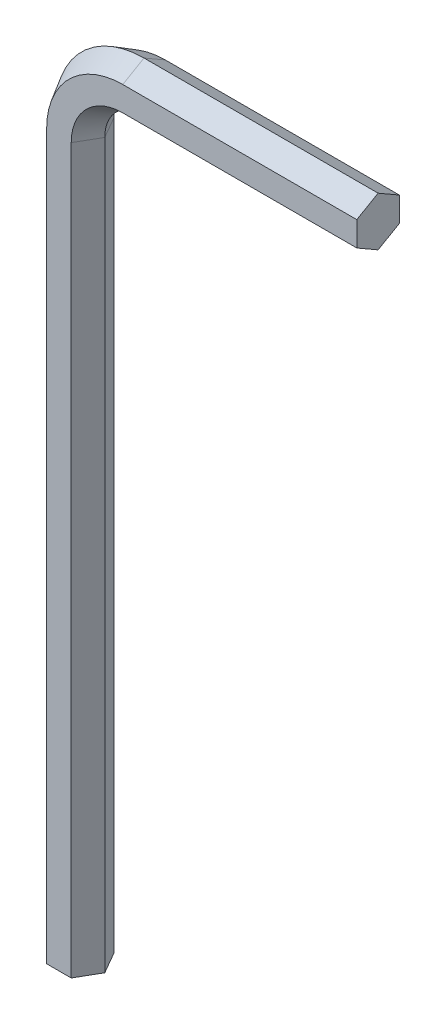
ISO-10303-21;
HEADER;
FILE_DESCRIPTION(('STEP AP214'),'2;1');
FILE_NAME('part.step','',(''),(''),'','','');
FILE_SCHEMA(('AUTOMOTIVE_DESIGN { 1 0 10303 214 1 1 1 1 }'));
ENDSEC;
DATA;
#1=APPLICATION_CONTEXT('core data for automotive mechanical design processes');
#2=APPLICATION_PROTOCOL_DEFINITION('international standard','automotive_design',2000,#1);
#3=PRODUCT_CONTEXT('',#1,'mechanical');
#4=PRODUCT('Part','Part','',(#3));
#5=PRODUCT_RELATED_PRODUCT_CATEGORY('part','',(#4));
#6=PRODUCT_DEFINITION_FORMATION('','',#4);
#7=PRODUCT_DEFINITION_CONTEXT('part definition',#1,'design');
#8=PRODUCT_DEFINITION('design','',#6,#7);
#9=PRODUCT_DEFINITION_SHAPE('','',#8);
#10=(LENGTH_UNIT() NAMED_UNIT(*) SI_UNIT(.MILLI.,.METRE.));
#11=(NAMED_UNIT(*) PLANE_ANGLE_UNIT() SI_UNIT($,.RADIAN.));
#12=(NAMED_UNIT(*) SI_UNIT($,.STERADIAN.) SOLID_ANGLE_UNIT());
#13=UNCERTAINTY_MEASURE_WITH_UNIT(LENGTH_MEASURE(1.E-05),#10,'distance_accuracy_value','');
#14=(GEOMETRIC_REPRESENTATION_CONTEXT(3) GLOBAL_UNCERTAINTY_ASSIGNED_CONTEXT((#13)) GLOBAL_UNIT_ASSIGNED_CONTEXT((#10,
#11,#12)) REPRESENTATION_CONTEXT('',''));
#15=CARTESIAN_POINT('',(0.,0.,0.));
#16=DIRECTION('',(0.,0.,1.));
#17=DIRECTION('',(1.,0.,0.));
#18=AXIS2_PLACEMENT_3D('',#15,#16,#17);
#19=CARTESIAN_POINT('',(6.,71.6905989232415,0.));
#20=DIRECTION('',(0.,-0.866025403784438,-0.500000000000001));
#21=DIRECTION('',(0.,0.500000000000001,-0.866025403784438));
#22=AXIS2_PLACEMENT_3D('',#19,#20,#21);
#23=PLANE('',#22);
#24=DIRECTION('',(0.,0.500000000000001,-0.866025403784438));
#25=VECTOR('',#24,1.);
#26=CARTESIAN_POINT('',(6.,71.6905989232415,0.));
#27=LINE('',#26,#25);
#28=CARTESIAN_POINT('',(6.,71.6905989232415,0.));
#29=VERTEX_POINT('',#28);
#30=CARTESIAN_POINT('',(6.,72.8452994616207,-2.));
#31=VERTEX_POINT('',#30);
#32=EDGE_CURVE('E130',#29,#31,#27,.T.);
#33=ORIENTED_EDGE('',*,*,#32,.T.);
#34=DIRECTION('',(1.,0.,0.));
#35=VECTOR('',#34,1.);
#36=CARTESIAN_POINT('',(6.,72.8452994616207,-2.));
#37=LINE('',#36,#35);
#38=CARTESIAN_POINT('',(28.,72.8452994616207,-2.));
#39=VERTEX_POINT('',#38);
#40=EDGE_CURVE('E39',#31,#39,#37,.T.);
#41=ORIENTED_EDGE('',*,*,#40,.T.);
#42=DIRECTION('',(0.,0.500000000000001,-0.866025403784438));
#43=VECTOR('',#42,1.);
#44=CARTESIAN_POINT('',(28.,71.6905989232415,0.));
#45=LINE('',#44,#43);
#46=CARTESIAN_POINT('',(28.,71.6905989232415,0.));
#47=VERTEX_POINT('',#46);
#48=EDGE_CURVE('E46',#47,#39,#45,.T.);
#49=ORIENTED_EDGE('',*,*,#48,.F.);
#50=DIRECTION('',(1.,0.,0.));
#51=VECTOR('',#50,1.);
#52=CARTESIAN_POINT('',(6.,71.6905989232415,0.));
#53=LINE('',#52,#51);
#54=EDGE_CURVE('E11',#29,#47,#53,.T.);
#55=ORIENTED_EDGE('',*,*,#54,.F.);
#56=EDGE_LOOP('',(#33,#41,#49,#55));
#57=FACE_BOUND('',#56,.T.);
#58=ADVANCED_FACE('F32',(#57),#23,.T.);
#59=CARTESIAN_POINT('',(6.,75.1547005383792,-2.));
#60=DIRECTION('',(0.,0.866025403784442,-0.499999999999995));
#61=DIRECTION('',(0.,0.499999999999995,0.866025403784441));
#62=AXIS2_PLACEMENT_3D('',#59,#60,#61);
#63=PLANE('',#62);
#64=DIRECTION('',(0.,0.499999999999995,0.866025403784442));
#65=VECTOR('',#64,1.);
#66=CARTESIAN_POINT('',(6.,75.1547005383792,-2.));
#67=LINE('',#66,#65);
#68=CARTESIAN_POINT('',(6.,75.1547005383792,-2.));
#69=VERTEX_POINT('',#68);
#70=CARTESIAN_POINT('',(6.,76.3094010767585,0.));
#71=VERTEX_POINT('',#70);
#72=EDGE_CURVE('E170',#69,#71,#67,.T.);
#73=ORIENTED_EDGE('',*,*,#72,.T.);
#74=DIRECTION('',(1.,0.,0.));
#75=VECTOR('',#74,1.);
#76=CARTESIAN_POINT('',(6.,76.3094010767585,0.));
#77=LINE('',#76,#75);
#78=CARTESIAN_POINT('',(28.,76.3094010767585,0.));
#79=VERTEX_POINT('',#78);
#80=EDGE_CURVE('E203',#71,#79,#77,.T.);
#81=ORIENTED_EDGE('',*,*,#80,.T.);
#82=DIRECTION('',(0.,0.499999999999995,0.866025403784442));
#83=VECTOR('',#82,1.);
#84=CARTESIAN_POINT('',(28.,75.1547005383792,-2.));
#85=LINE('',#84,#83);
#86=CARTESIAN_POINT('',(28.,75.1547005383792,-2.));
#87=VERTEX_POINT('',#86);
#88=EDGE_CURVE('E192',#87,#79,#85,.T.);
#89=ORIENTED_EDGE('',*,*,#88,.F.);
#90=DIRECTION('',(1.,0.,0.));
#91=VECTOR('',#90,1.);
#92=CARTESIAN_POINT('',(6.,75.1547005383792,-2.));
#93=LINE('',#92,#91);
#94=EDGE_CURVE('E206',#69,#87,#93,.T.);
#95=ORIENTED_EDGE('',*,*,#94,.F.);
#96=EDGE_LOOP('',(#73,#81,#89,#95));
#97=FACE_BOUND('',#96,.T.);
#98=ADVANCED_FACE('F244',(#97),#63,.T.);
#99=CARTESIAN_POINT('',(6.,76.3094010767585,0.));
#100=DIRECTION('',(0.,0.866025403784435,0.500000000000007));
#101=DIRECTION('',(0.,-0.500000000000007,0.866025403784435));
#102=AXIS2_PLACEMENT_3D('',#99,#100,#101);
#103=PLANE('',#102);
#104=DIRECTION('',(0.,-0.500000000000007,0.866025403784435));
#105=VECTOR('',#104,1.);
#106=CARTESIAN_POINT('',(6.,76.3094010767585,0.));
#107=LINE('',#106,#105);
#108=CARTESIAN_POINT('',(6.,75.1547005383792,2.00000000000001));
#109=VERTEX_POINT('',#108);
#110=EDGE_CURVE('E162',#71,#109,#107,.T.);
#111=ORIENTED_EDGE('',*,*,#110,.T.);
#112=DIRECTION('',(1.,0.,0.));
#113=VECTOR('',#112,1.);
#114=CARTESIAN_POINT('',(6.,75.1547005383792,2.00000000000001));
#115=LINE('',#114,#113);
#116=CARTESIAN_POINT('',(28.,75.1547005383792,2.00000000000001));
#117=VERTEX_POINT('',#116);
#118=EDGE_CURVE('E200',#109,#117,#115,.T.);
#119=ORIENTED_EDGE('',*,*,#118,.T.);
#120=DIRECTION('',(0.,-0.500000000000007,0.866025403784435));
#121=VECTOR('',#120,1.);
#122=CARTESIAN_POINT('',(28.,76.3094010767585,0.));
#123=LINE('',#122,#121);
#124=EDGE_CURVE('E189',#79,#117,#123,.T.);
#125=ORIENTED_EDGE('',*,*,#124,.F.);
#126=ORIENTED_EDGE('',*,*,#80,.F.);
#127=EDGE_LOOP('',(#111,#119,#125,#126));
#128=FACE_BOUND('',#127,.T.);
#129=ADVANCED_FACE('F249',(#128),#103,.T.);
#130=CARTESIAN_POINT('',(6.,72.8452994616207,1.99999999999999));
#131=DIRECTION('',(0.,-0.866025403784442,0.499999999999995));
#132=DIRECTION('',(0.,-0.499999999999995,-0.866025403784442));
#133=AXIS2_PLACEMENT_3D('',#130,#131,#132);
#134=PLANE('',#133);
#135=DIRECTION('',(0.,-0.499999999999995,-0.866025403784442));
#136=VECTOR('',#135,1.);
#137=CARTESIAN_POINT('',(6.,72.8452994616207,1.99999999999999));
#138=LINE('',#137,#136);
#139=CARTESIAN_POINT('',(6.,72.8452994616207,1.99999999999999));
#140=VERTEX_POINT('',#139);
#141=EDGE_CURVE('E159',#140,#29,#138,.T.);
#142=ORIENTED_EDGE('',*,*,#141,.T.);
#143=ORIENTED_EDGE('',*,*,#54,.T.);
#144=DIRECTION('',(0.,-0.499999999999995,-0.866025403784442));
#145=VECTOR('',#144,1.);
#146=CARTESIAN_POINT('',(28.,72.8452994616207,1.99999999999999));
#147=LINE('',#146,#145);
#148=CARTESIAN_POINT('',(28.,72.8452994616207,1.99999999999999));
#149=VERTEX_POINT('',#148);
#150=EDGE_CURVE('E133',#149,#47,#147,.T.);
#151=ORIENTED_EDGE('',*,*,#150,.F.);
#152=DIRECTION('',(1.,0.,0.));
#153=VECTOR('',#152,1.);
#154=CARTESIAN_POINT('',(6.,72.8452994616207,1.99999999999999));
#155=LINE('',#154,#153);
#156=EDGE_CURVE('E197',#140,#149,#155,.T.);
#157=ORIENTED_EDGE('',*,*,#156,.F.);
#158=EDGE_LOOP('',(#142,#143,#151,#157));
#159=FACE_BOUND('',#158,.T.);
#160=ADVANCED_FACE('F253',(#159),#134,.T.);
#161=CARTESIAN_POINT('',(6.,68.,0.));
#162=DIRECTION('',(0.,0.,-1.));
#163=DIRECTION('',(-1.,0.,0.));
#164=AXIS2_PLACEMENT_3D('',#161,#162,#163);
#165=CONICAL_SURFACE('',#164,3.6905989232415,0.5235987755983);
#166=DIRECTION('',(-0.500000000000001,0.,-0.866025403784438));
#167=VECTOR('',#166,1.);
#168=CARTESIAN_POINT('',(2.3094010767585,68.,0.));
#169=LINE('',#168,#167);
#170=CARTESIAN_POINT('',(2.3094010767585,68.,0.));
#171=VERTEX_POINT('',#170);
#172=CARTESIAN_POINT('',(1.15470053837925,68.,-2.));
#173=VERTEX_POINT('',#172);
#174=EDGE_CURVE('E127',#171,#173,#169,.T.);
#175=ORIENTED_EDGE('',*,*,#174,.T.);
#176=CARTESIAN_POINT('',(6.,68.,-2.));
#177=DIRECTION('',(0.,0.,-1.));
#178=DIRECTION('',(-1.,0.,0.));
#179=AXIS2_PLACEMENT_3D('',#176,#177,#178);
#180=CIRCLE('',#179,4.84529946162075);
#181=EDGE_CURVE('E134',#173,#31,#180,.T.);
#182=ORIENTED_EDGE('',*,*,#181,.T.);
#183=ORIENTED_EDGE('',*,*,#32,.F.);
#184=CARTESIAN_POINT('',(6.,68.,0.));
#185=DIRECTION('',(0.,0.,-1.));
#186=DIRECTION('',(-1.,0.,0.));
#187=AXIS2_PLACEMENT_3D('',#184,#185,#186);
#188=CIRCLE('',#187,3.6905989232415);
#189=EDGE_CURVE('E122',#171,#29,#188,.T.);
#190=ORIENTED_EDGE('',*,*,#189,.F.);
#191=EDGE_LOOP('',(#175,#182,#183,#190));
#192=FACE_BOUND('',#191,.T.);
#193=ADVANCED_FACE('F124',(#192),#165,.F.);
#194=CARTESIAN_POINT('',(6.,68.,-2.));
#195=DIRECTION('',(0.,0.,1.));
#196=DIRECTION('',(1.,0.,0.));
#197=AXIS2_PLACEMENT_3D('',#194,#195,#196);
#198=CONICAL_SURFACE('',#197,7.15470053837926,0.523598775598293);
#199=DIRECTION('',(-0.499999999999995,0.,0.866025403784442));
#200=VECTOR('',#199,1.);
#201=CARTESIAN_POINT('',(-1.15470053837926,68.,-2.));
#202=LINE('',#201,#200);
#203=CARTESIAN_POINT('',(-1.15470053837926,68.,-2.));
#204=VERTEX_POINT('',#203);
#205=CARTESIAN_POINT('',(-2.3094010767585,68.,0.));
#206=VERTEX_POINT('',#205);
#207=EDGE_CURVE('E154',#204,#206,#202,.T.);
#208=ORIENTED_EDGE('',*,*,#207,.T.);
#209=CARTESIAN_POINT('',(6.,68.,0.));
#210=DIRECTION('',(0.,0.,-1.));
#211=DIRECTION('',(-1.,0.,0.));
#212=AXIS2_PLACEMENT_3D('',#209,#210,#211);
#213=CIRCLE('',#212,8.3094010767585);
#214=EDGE_CURVE('E178',#206,#71,#213,.T.);
#215=ORIENTED_EDGE('',*,*,#214,.T.);
#216=ORIENTED_EDGE('',*,*,#72,.F.);
#217=CARTESIAN_POINT('',(6.,68.,-2.));
#218=DIRECTION('',(0.,0.,-1.));
#219=DIRECTION('',(-1.,0.,0.));
#220=AXIS2_PLACEMENT_3D('',#217,#218,#219);
#221=CIRCLE('',#220,7.15470053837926);
#222=EDGE_CURVE('E181',#204,#69,#221,.T.);
#223=ORIENTED_EDGE('',*,*,#222,.F.);
#224=EDGE_LOOP('',(#208,#215,#216,#223));
#225=FACE_BOUND('',#224,.T.);
#226=ADVANCED_FACE('F241',(#225),#198,.T.);
#227=CARTESIAN_POINT('',(6.,68.,0.));
#228=DIRECTION('',(0.,0.,-1.));
#229=DIRECTION('',(-1.,0.,0.));
#230=AXIS2_PLACEMENT_3D('',#227,#228,#229);
#231=CONICAL_SURFACE('',#230,8.3094010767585,0.523598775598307);
#232=DIRECTION('',(0.500000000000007,0.,0.866025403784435));
#233=VECTOR('',#232,1.);
#234=CARTESIAN_POINT('',(-2.3094010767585,68.,0.));
#235=LINE('',#234,#233);
#236=CARTESIAN_POINT('',(-1.15470053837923,68.,2.00000000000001));
#237=VERTEX_POINT('',#236);
#238=EDGE_CURVE('E229',#206,#237,#235,.T.);
#239=ORIENTED_EDGE('',*,*,#238,.T.);
#240=CARTESIAN_POINT('',(6.,68.,2.00000000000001));
#241=DIRECTION('',(0.,0.,-1.));
#242=DIRECTION('',(-1.,0.,0.));
#243=AXIS2_PLACEMENT_3D('',#240,#241,#242);
#244=CIRCLE('',#243,7.15470053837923);
#245=EDGE_CURVE('E175',#237,#109,#244,.T.);
#246=ORIENTED_EDGE('',*,*,#245,.T.);
#247=ORIENTED_EDGE('',*,*,#110,.F.);
#248=ORIENTED_EDGE('',*,*,#214,.F.);
#249=EDGE_LOOP('',(#239,#246,#247,#248));
#250=FACE_BOUND('',#249,.T.);
#251=ADVANCED_FACE('F247',(#250),#231,.T.);
#252=CARTESIAN_POINT('',(6.,68.,1.99999999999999));
#253=DIRECTION('',(0.,0.,1.));
#254=DIRECTION('',(1.,0.,0.));
#255=AXIS2_PLACEMENT_3D('',#252,#253,#254);
#256=CONICAL_SURFACE('',#255,4.84529946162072,0.523598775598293);
#257=DIRECTION('',(0.499999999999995,0.,-0.866025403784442));
#258=VECTOR('',#257,1.);
#259=CARTESIAN_POINT('',(1.15470053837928,68.,1.99999999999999));
#260=LINE('',#259,#258);
#261=CARTESIAN_POINT('',(1.15470053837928,68.,1.99999999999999));
#262=VERTEX_POINT('',#261);
#263=EDGE_CURVE('E137',#262,#171,#260,.T.);
#264=ORIENTED_EDGE('',*,*,#263,.T.);
#265=ORIENTED_EDGE('',*,*,#189,.T.);
#266=ORIENTED_EDGE('',*,*,#141,.F.);
#267=CARTESIAN_POINT('',(6.,68.,1.99999999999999));
#268=DIRECTION('',(0.,0.,-1.));
#269=DIRECTION('',(-1.,0.,0.));
#270=AXIS2_PLACEMENT_3D('',#267,#268,#269);
#271=CIRCLE('',#270,4.84529946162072);
#272=EDGE_CURVE('E140',#262,#140,#271,.T.);
#273=ORIENTED_EDGE('',*,*,#272,.F.);
#274=EDGE_LOOP('',(#264,#265,#266,#273));
#275=FACE_BOUND('',#274,.T.);
#276=ADVANCED_FACE('F138',(#275),#256,.F.);
#277=CARTESIAN_POINT('',(1.15470053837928,68.,1.99999999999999));
#278=DIRECTION('',(-0.866025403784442,0.,-0.499999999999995));
#279=DIRECTION('',(-0.499999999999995,0.,0.866025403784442));
#280=AXIS2_PLACEMENT_3D('',#277,#278,#279);
#281=PLANE('',#280);
#282=DIRECTION('',(0.499999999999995,0.,-0.866025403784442));
#283=VECTOR('',#282,1.);
#284=CARTESIAN_POINT('',(1.15470053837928,0.,1.99999999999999));
#285=LINE('',#284,#283);
#286=CARTESIAN_POINT('',(1.15470053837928,0.,1.99999999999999));
#287=VERTEX_POINT('',#286);
#288=CARTESIAN_POINT('',(2.3094010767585,0.,0.));
#289=VERTEX_POINT('',#288);
#290=EDGE_CURVE('E158',#287,#289,#285,.T.);
#291=ORIENTED_EDGE('',*,*,#290,.T.);
#292=DIRECTION('',(0.,-1.,0.));
#293=VECTOR('',#292,1.);
#294=CARTESIAN_POINT('',(2.3094010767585,68.,0.));
#295=LINE('',#294,#293);
#296=EDGE_CURVE('E150',#171,#289,#295,.T.);
#297=ORIENTED_EDGE('',*,*,#296,.F.);
#298=ORIENTED_EDGE('',*,*,#263,.F.);
#299=DIRECTION('',(0.,-1.,0.));
#300=VECTOR('',#299,1.);
#301=CARTESIAN_POINT('',(1.15470053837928,68.,1.99999999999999));
#302=LINE('',#301,#300);
#303=EDGE_CURVE('E226',#262,#287,#302,.T.);
#304=ORIENTED_EDGE('',*,*,#303,.T.);
#305=EDGE_LOOP('',(#291,#297,#298,#304));
#306=FACE_BOUND('',#305,.T.);
#307=ADVANCED_FACE('F156',(#306),#281,.F.);
#308=CARTESIAN_POINT('',(2.3094010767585,68.,0.));
#309=DIRECTION('',(-0.866025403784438,0.,0.500000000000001));
#310=DIRECTION('',(0.500000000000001,0.,0.866025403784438));
#311=AXIS2_PLACEMENT_3D('',#308,#309,#310);
#312=PLANE('',#311);
#313=DIRECTION('',(-0.500000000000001,0.,-0.866025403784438));
#314=VECTOR('',#313,1.);
#315=CARTESIAN_POINT('',(2.3094010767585,0.,0.));
#316=LINE('',#315,#314);
#317=CARTESIAN_POINT('',(1.15470053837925,0.,-2.));
#318=VERTEX_POINT('',#317);
#319=EDGE_CURVE('E215',#289,#318,#316,.T.);
#320=ORIENTED_EDGE('',*,*,#319,.T.);
#321=DIRECTION('',(0.,-1.,0.));
#322=VECTOR('',#321,1.);
#323=CARTESIAN_POINT('',(1.15470053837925,68.,-2.));
#324=LINE('',#323,#322);
#325=EDGE_CURVE('E153',#173,#318,#324,.T.);
#326=ORIENTED_EDGE('',*,*,#325,.F.);
#327=ORIENTED_EDGE('',*,*,#174,.F.);
#328=ORIENTED_EDGE('',*,*,#296,.T.);
#329=EDGE_LOOP('',(#320,#326,#327,#328));
#330=FACE_BOUND('',#329,.T.);
#331=ADVANCED_FACE('F149',(#330),#312,.F.);
#332=CARTESIAN_POINT('',(1.15470053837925,68.,-2.));
#333=DIRECTION('',(0.,0.,1.));
#334=DIRECTION('',(1.,0.,0.));
#335=AXIS2_PLACEMENT_3D('',#332,#333,#334);
#336=PLANE('',#335);
#337=DIRECTION('',(-1.,0.,0.));
#338=VECTOR('',#337,1.);
#339=CARTESIAN_POINT('',(1.15470053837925,0.,-2.));
#340=LINE('',#339,#338);
#341=CARTESIAN_POINT('',(-1.15470053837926,0.,-2.));
#342=VERTEX_POINT('',#341);
#343=EDGE_CURVE('E210',#318,#342,#340,.T.);
#344=ORIENTED_EDGE('',*,*,#343,.T.);
#345=DIRECTION('',(0.,-1.,0.));
#346=VECTOR('',#345,1.);
#347=CARTESIAN_POINT('',(-1.15470053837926,68.,-2.));
#348=LINE('',#347,#346);
#349=EDGE_CURVE('E164',#204,#342,#348,.T.);
#350=ORIENTED_EDGE('',*,*,#349,.F.);
#351=ORIENTED_EDGE('',*,*,#222,.T.);
#352=ORIENTED_EDGE('',*,*,#94,.T.);
#353=DIRECTION('',(0.,1.,0.));
#354=VECTOR('',#353,1.);
#355=CARTESIAN_POINT('',(28.,72.8452994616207,-2.));
#356=LINE('',#355,#354);
#357=EDGE_CURVE('E54',#39,#87,#356,.T.);
#358=ORIENTED_EDGE('',*,*,#357,.F.);
#359=ORIENTED_EDGE('',*,*,#40,.F.);
#360=ORIENTED_EDGE('',*,*,#181,.F.);
#361=ORIENTED_EDGE('',*,*,#325,.T.);
#362=EDGE_LOOP('',(#344,#350,#351,#352,#358,#359,#360,#361));
#363=FACE_BOUND('',#362,.T.);
#364=ADVANCED_FACE('F207',(#363),#336,.F.);
#365=CARTESIAN_POINT('',(-1.15470053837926,68.,-2.));
#366=DIRECTION('',(0.866025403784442,0.,0.499999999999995));
#367=DIRECTION('',(0.499999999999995,0.,-0.866025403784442));
#368=AXIS2_PLACEMENT_3D('',#365,#366,#367);
#369=PLANE('',#368);
#370=DIRECTION('',(-0.499999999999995,0.,0.866025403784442));
#371=VECTOR('',#370,1.);
#372=CARTESIAN_POINT('',(-1.15470053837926,0.,-2.));
#373=LINE('',#372,#371);
#374=CARTESIAN_POINT('',(-2.3094010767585,0.,0.));
#375=VERTEX_POINT('',#374);
#376=EDGE_CURVE('E217',#342,#375,#373,.T.);
#377=ORIENTED_EDGE('',*,*,#376,.T.);
#378=DIRECTION('',(0.,-1.,0.));
#379=VECTOR('',#378,1.);
#380=CARTESIAN_POINT('',(-2.3094010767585,68.,0.));
#381=LINE('',#380,#379);
#382=EDGE_CURVE('E232',#206,#375,#381,.T.);
#383=ORIENTED_EDGE('',*,*,#382,.F.);
#384=ORIENTED_EDGE('',*,*,#207,.F.);
#385=ORIENTED_EDGE('',*,*,#349,.T.);
#386=EDGE_LOOP('',(#377,#383,#384,#385));
#387=FACE_BOUND('',#386,.T.);
#388=ADVANCED_FACE('F236',(#387),#369,.F.);
#389=CARTESIAN_POINT('',(-2.3094010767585,68.,0.));
#390=DIRECTION('',(0.866025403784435,0.,-0.500000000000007));
#391=DIRECTION('',(-0.500000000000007,0.,-0.866025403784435));
#392=AXIS2_PLACEMENT_3D('',#389,#390,#391);
#393=PLANE('',#392);
#394=DIRECTION('',(0.500000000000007,0.,0.866025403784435));
#395=VECTOR('',#394,1.);
#396=CARTESIAN_POINT('',(-2.3094010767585,0.,0.));
#397=LINE('',#396,#395);
#398=CARTESIAN_POINT('',(-1.15470053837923,0.,2.00000000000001));
#399=VERTEX_POINT('',#398);
#400=EDGE_CURVE('E219',#375,#399,#397,.T.);
#401=ORIENTED_EDGE('',*,*,#400,.T.);
#402=DIRECTION('',(0.,-1.,0.));
#403=VECTOR('',#402,1.);
#404=CARTESIAN_POINT('',(-1.15470053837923,68.,2.00000000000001));
#405=LINE('',#404,#403);
#406=EDGE_CURVE('E228',#237,#399,#405,.T.);
#407=ORIENTED_EDGE('',*,*,#406,.F.);
#408=ORIENTED_EDGE('',*,*,#238,.F.);
#409=ORIENTED_EDGE('',*,*,#382,.T.);
#410=EDGE_LOOP('',(#401,#407,#408,#409));
#411=FACE_BOUND('',#410,.T.);
#412=ADVANCED_FACE('F262',(#411),#393,.F.);
#413=CARTESIAN_POINT('',(-1.15470053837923,68.,2.00000000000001));
#414=DIRECTION('',(0.,0.,-1.));
#415=DIRECTION('',(-1.,0.,0.));
#416=AXIS2_PLACEMENT_3D('',#413,#414,#415);
#417=PLANE('',#416);
#418=DIRECTION('',(1.,0.,0.));
#419=VECTOR('',#418,1.);
#420=CARTESIAN_POINT('',(-1.15470053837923,0.,2.00000000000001));
#421=LINE('',#420,#419);
#422=EDGE_CURVE('E145',#399,#287,#421,.T.);
#423=ORIENTED_EDGE('',*,*,#422,.T.);
#424=ORIENTED_EDGE('',*,*,#303,.F.);
#425=ORIENTED_EDGE('',*,*,#272,.T.);
#426=ORIENTED_EDGE('',*,*,#156,.T.);
#427=DIRECTION('',(0.,-1.,0.));
#428=VECTOR('',#427,1.);
#429=CARTESIAN_POINT('',(28.,75.1547005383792,2.00000000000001));
#430=LINE('',#429,#428);
#431=EDGE_CURVE('E186',#117,#149,#430,.T.);
#432=ORIENTED_EDGE('',*,*,#431,.F.);
#433=ORIENTED_EDGE('',*,*,#118,.F.);
#434=ORIENTED_EDGE('',*,*,#245,.F.);
#435=ORIENTED_EDGE('',*,*,#406,.T.);
#436=EDGE_LOOP('',(#423,#424,#425,#426,#432,#433,#434,#435));
#437=FACE_BOUND('',#436,.T.);
#438=ADVANCED_FACE('F255',(#437),#417,.F.);
#439=CARTESIAN_POINT('',(28.,74.,0.));
#440=DIRECTION('',(1.,0.,0.));
#441=DIRECTION('',(0.,0.,1.));
#442=AXIS2_PLACEMENT_3D('',#439,#440,#441);
#443=PLANE('',#442);
#444=ORIENTED_EDGE('',*,*,#150,.T.);
#445=ORIENTED_EDGE('',*,*,#48,.T.);
#446=ORIENTED_EDGE('',*,*,#357,.T.);
#447=ORIENTED_EDGE('',*,*,#88,.T.);
#448=ORIENTED_EDGE('',*,*,#124,.T.);
#449=ORIENTED_EDGE('',*,*,#431,.T.);
#450=EDGE_LOOP('',(#444,#445,#446,#447,#448,#449));
#451=FACE_BOUND('',#450,.T.);
#452=ADVANCED_FACE('F251',(#451),#443,.T.);
#453=CARTESIAN_POINT('',(0.,0.,0.));
#454=DIRECTION('',(0.,1.,0.));
#455=DIRECTION('',(0.,0.,1.));
#456=AXIS2_PLACEMENT_3D('',#453,#454,#455);
#457=PLANE('',#456);
#458=ORIENTED_EDGE('',*,*,#290,.F.);
#459=ORIENTED_EDGE('',*,*,#422,.F.);
#460=ORIENTED_EDGE('',*,*,#400,.F.);
#461=ORIENTED_EDGE('',*,*,#376,.F.);
#462=ORIENTED_EDGE('',*,*,#343,.F.);
#463=ORIENTED_EDGE('',*,*,#319,.F.);
#464=EDGE_LOOP('',(#458,#459,#460,#461,#462,#463));
#465=FACE_BOUND('',#464,.T.);
#466=ADVANCED_FACE('F214',(#465),#457,.F.);
#467=CLOSED_SHELL('',(#58,#98,#129,#160,#193,#226,#251,#276,#307,#331,#364,#388,#412,#438,#452,#466));
#468=MANIFOLD_SOLID_BREP('B2',#467);
#469=ADVANCED_BREP_SHAPE_REPRESENTATION('',(#18,#468),#14);
#470=SHAPE_DEFINITION_REPRESENTATION(#9,#469);
ENDSEC;
END-ISO-10303-21;
